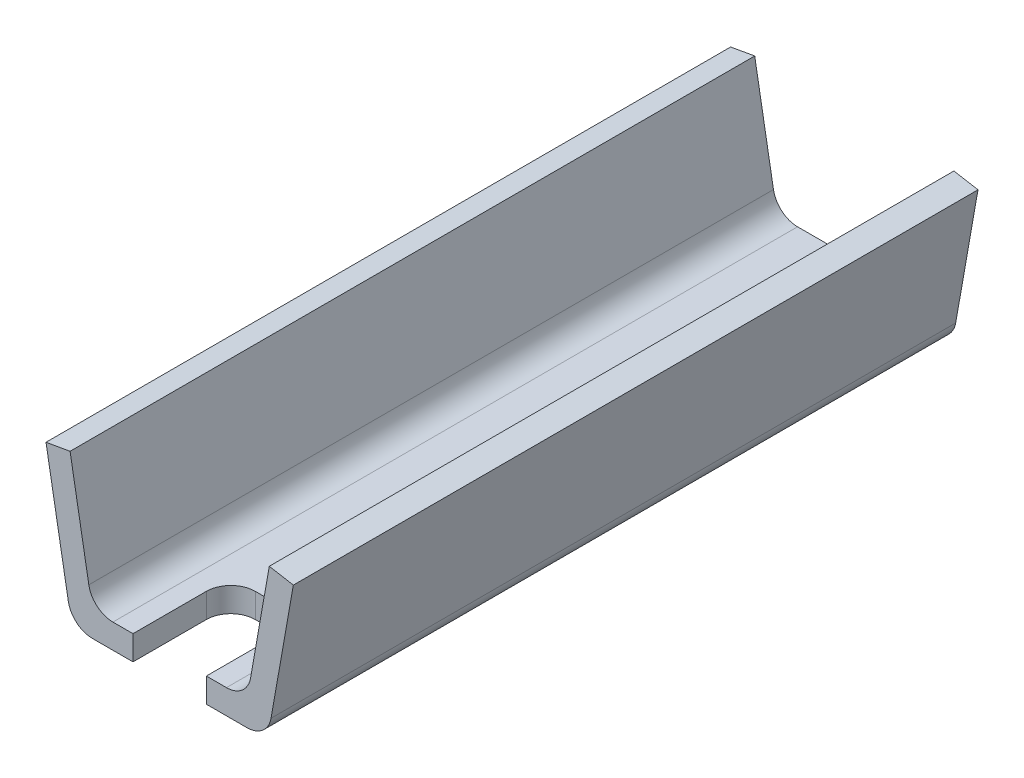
from build123d import *

# Parameters (mm, degrees)
EXTRUDE_1_DEPTH     = 140
SKETCH_2_W          = 15
SKETCH_2_H          = 11.100707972
CUT_EXTRUDE_1_DEPTH = 20
FILLET_1_R          = 5


with BuildPart() as part:
    # Sketch 1 → Extrude 1 (new body)
    with BuildSketch(Plane.XY):
        with BuildLine():
            Line((-15.804501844, 0), (15.804501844, 0))
            ThreePointArc((15.804501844, 0), (19.018439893, 1.169777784), (20.728540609, 4.131759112))
            Line((20.728540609, 4.131759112), (25.289809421, 30))
            Line((25.289809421, 30), (20.365770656, 30.868240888))
            Line((20.365770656, 30.868240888), (16.533042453, 9.131759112))
            ThreePointArc((16.533042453, 9.131759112), (14.822941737, 6.169777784), (11.609003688, 5))
            Line((11.609003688, 5), (-11.609003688, 5))
            ThreePointArc((-11.609003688, 5), (-14.822941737, 6.169777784), (-16.533042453, 9.131759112))
            Line((-16.533042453, 9.131759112), (-20.365770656, 30.868240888))
            Line((-20.365770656, 30.868240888), (-25.289809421, 30))
            Line((-25.289809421, 30), (-20.728540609, 4.131759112))
            ThreePointArc((-20.728540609, 4.131759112), (-19.018439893, 1.169777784), (-15.804501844, 0))
        make_face()
    extrude(amount=EXTRUDE_1_DEPTH)

    # Sketch 2 → Cut-Extrude 1 (cut)
    with BuildSketch(Plane.XY.offset(140)):
        with Locations((0, 1.832703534)):
            Rectangle(SKETCH_2_W, SKETCH_2_H)
    extrude(amount=-CUT_EXTRUDE_1_DEPTH, mode=Mode.SUBTRACT)

    # Fillet 1
    fillet_1_edges = [part.edges().sort_by_distance(p)[0] for p in [
        (-7.5, 2.5, 120),
        (7.5, 2.5, 120),
    ]]
    fillet(fillet_1_edges, radius=FILLET_1_R)


solid = part.part
